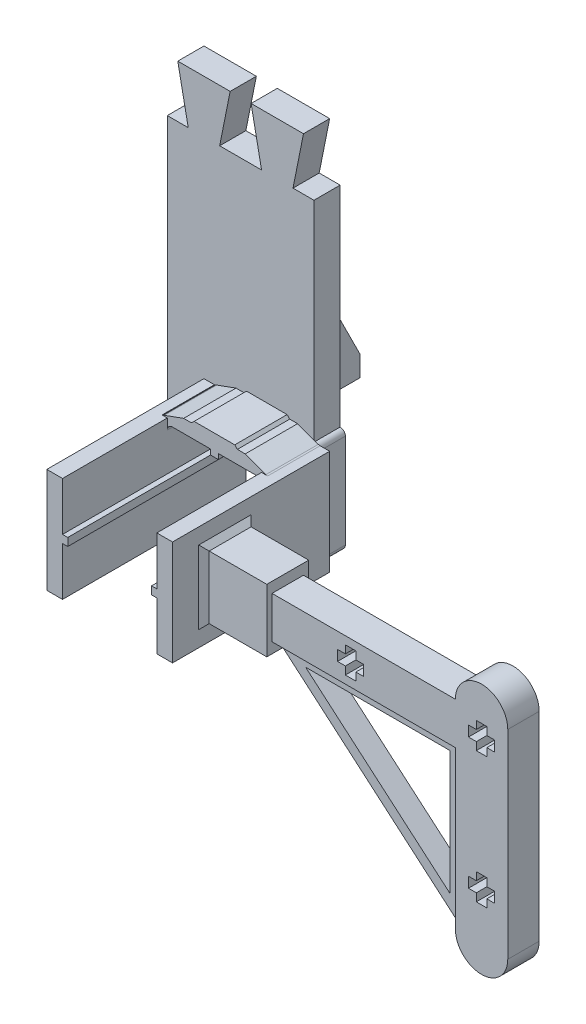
from build123d import *

# Parameters (mm, degrees)
SKETCH_1_W             = 20
SKETCH_1_H             = 20
SKETCH_1_W_2           = 18
SKETCH_1_H_2           = 18
EXTRUDE_1_DEPTH        = 10
FILLET_1_R             = 1
SKETCH_3_W             = 2
SKETCH_3_H             = 20
EXTRUDE_2_DEPTH        = 10
EXTRUDE_3_DEPTH        = 20
FILLET_3_R             = 1
SKETCH_5_W             = 1.5
SKETCH_5_H             = 2
SKETCH_5_W_2           = 2
SKETCH_5_H_2           = 1.5
EXTRUDE_4_DEPTH        = 10
SKETCH_6_W             = 12
SKETCH_6_H             = 12
EXTRUDE_5_DEPTH        = 4
SKETCH_7_W             = 6
SKETCH_7_H             = 8
EXTRUDE_6_DEPTH        = 35
EXTRUDE_7_DEPTH        = 3
RIB_1_REACH            = 83.744
SKETCH_11_WALL_W       = 211.584724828
SKETCH_11_WALL_H       = 4
CUT_EXTRUDE_1_DEPTH    = 83.255698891
CHAMFER_1_SIZE         = 1
CUT_EXTRUDE_2_DEPTH    = 6
PATTERN_LINEAR_1_COUNT = 2
PATTERN_LINEAR_1_PITCH = 25
PATTERN_LINEAR_2_COUNT = 2
PATTERN_LINEAR_2_PITCH = 25
SKETCH_14_W            = 1
SKETCH_14_H            = 1.5
SKETCH_14_W_2          = 1.5
SKETCH_14_H_2          = 1
EXTRUDE_10_DEPTH       = 5
SKETCH_17_W            = 18
SKETCH_17_H            = 5
EXTRUDE_11_DEPTH       = 50
EXTRUDE_START          = -5
EXTRUDE_12_DEPTH       = 5
CUT_EXTRUDE_3_DEPTH    = 38
SKETCH_22_W            = 1
SKETCH_22_H            = 1.5
EXTRUDE_13_DEPTH       = 20
EXTRUDE_16_DEPTH       = 1.5
SKETCH_24_W            = 1
SKETCH_24_H            = 1.5
EXTRUDE_17_DEPTH       = 20


with BuildPart() as part:
    # Sketch 1 → Extrude 1 (new body)
    # profile 1 of 4: a face of its own
    with BuildSketch(Plane.XY):
        Polygon((10, -10), (5.878783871, -11.5), (4.378783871, -11.5), (3.878783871, -12), (-3.878783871, -12), (-4.378783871, -11.5), (-5.878783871, -11.5), (-10, -10), align=None)
    # profile 2 of 4: a face of its own
    with BuildSketch(Plane.XY):
        Rectangle(SKETCH_1_W, SKETCH_1_H)
        Rectangle(SKETCH_1_W_2, SKETCH_1_H_2, mode=Mode.SUBTRACT)
    # profile 3 of 4: a face of its own
    with BuildSketch(Plane.XY):
        Polygon((-10, -10), (-11.5, -5.878783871), (-11.5, -4.378783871), (-12, -3.878783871), (-12, 3.878783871), (-11.5, 4.378783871), (-11.5, 5.878783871), (-10, 10), align=None)
    # profile 4 of 4: a face of its own
    with BuildSketch(Plane.XY):
        Polygon((-10, 10), (-5.878783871, 11.5), (-4.378783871, 11.5), (-3.878783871, 12), (3.878783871, 12), (4.378783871, 11.5), (5.878783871, 11.5), (10, 10), align=None)
    extrude(amount=EXTRUDE_1_DEPTH)

    # Fillet 1
    fillet_1_edges = [part.edges().sort_by_distance(p)[0] for p in [
        (-9, -9, 5),
        (9, -9, 5),
        (9, 9, 5),
        (-9, 9, 5),
    ]]
    fillet(fillet_1_edges, radius=FILLET_1_R)

    # Sketch 3 → Extrude 2 (add)
    with BuildSketch(Plane.XY.offset(10)):
        with Locations((11, 0)):
            Rectangle(SKETCH_3_W, SKETCH_3_H)
    extrude_2 = extrude(amount=-EXTRUDE_2_DEPTH)

    # Sketch 4 → Extrude 3 (add)
    with BuildSketch(Plane.XY.offset(10)):
        Polygon((10, 10), (9, 10), (9, -10), (12, -10), (12, 10), align=None)
    extrude_3 = extrude(amount=EXTRUDE_3_DEPTH)

    # Fillet 3
    fillet_3_edges = [part.edges().sort_by_distance(p)[0] for p in [
        (-10, -10, 5),
        (-10, 10, 5),
        (10, 10, 5),
        (10, -10, 5),
    ]]
    fillet(fillet_3_edges, radius=FILLET_3_R)

    # Sketch 5 → Extrude 4 (add)
    with BuildSketch(Plane.XY.offset(10)):
        with Locations((0, 9)):
            Rectangle(SKETCH_5_W, SKETCH_5_H)
        with Locations((9, 0)):
            Rectangle(SKETCH_5_W_2, SKETCH_5_H_2)
        with Locations((0, -9)):
            Rectangle(SKETCH_5_W, SKETCH_5_H)
        with Locations((-9, 0)):
            Rectangle(SKETCH_5_W_2, SKETCH_5_H_2)
    extrude(amount=-EXTRUDE_4_DEPTH)

    # Sketch 6 → Extrude 5 (add, symmetric)
    with BuildSketch(Plane.XY.offset(20)):
        with Locations((18, 0)):
            Rectangle(SKETCH_6_W, SKETCH_6_H)
    extrude(amount=EXTRUDE_5_DEPTH, both=True)

    # Sketch 7 → Extrude 6 (add)
    with BuildSketch(Plane(origin=(24, 0, 0), x_dir=(0, 0, -1), z_dir=(1, 0, 0))):
        with Locations((-20, 0)):
            Rectangle(SKETCH_7_W, SKETCH_7_H)
    extrude(amount=EXTRUDE_6_DEPTH)

    # Sketch 8 → Extrude 7 (add, symmetric)
    with BuildSketch(Plane.XY.offset(20)):
        with BuildLine():
            Line((69, 4), (69, -34))
            ThreePointArc((69, -34), (64, -39), (59, -34))
            Line((59, -34), (59, 4))
            ThreePointArc((59, 4), (64, 9), (69, 4))
        make_face()
    extrude(amount=EXTRUDE_7_DEPTH, both=True)

    # Sketch 11 wall → Rib 1 (add, up to next)
    with BuildSketch(Plane(origin=(41.5, -19, 20), x_dir=(0.759256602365, -0.650791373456, 0), z_dir=(0.650791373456, 0.759256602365, 0)), mode=Mode.PRIVATE) as rib_1_sk1:
        Rectangle(SKETCH_11_WALL_W, SKETCH_11_WALL_H)
    rib_1_tool1 = extrude(rib_1_sk1.sketch, amount=RIB_1_REACH, mode=Mode.PRIVATE) - part.part
    add(rib_1_tool1.solids().sort_by_distance((41.5, -19, 20))[0])

    # Sketch 12 → Cut-Extrude 1 (cut, through all)
    with BuildSketch(Plane.XY.offset(22)):
        Polygon((29.406514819, -6), (57, -29.651558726), (57, -6), align=None)
    extrude(amount=-CUT_EXTRUDE_1_DEPTH, mode=Mode.SUBTRACT)

    # Chamfer 1
    chamfer_1_edges = [part.edges().sort_by_distance(p)[0] for p in [
        (12, 0, 16),
        (12, 6, 20),
        (12, -6, 20),
        (12, 0, 24),
    ]]
    chamfer(chamfer_1_edges, length=CHAMFER_1_SIZE)

    # Sketch 13 → Cut-Extrude 2 (cut)
    with BuildSketch(Plane.XY.offset(23)):
        Polygon((65, 1), (65, 2.5), (63, 2.5), (63, 1), (61.5, 1), (61.5, -1), (63, -1), (63, -2.5), (65, -2.5), (65, -1), (66.5, -1), (66.5, 1), align=None)
    cut_extrude_2 = extrude(amount=-CUT_EXTRUDE_2_DEPTH, mode=Mode.SUBTRACT)

    # Pattern Linear 1: Cut-Extrude 2 ×2
    with Locations(*[(0, -i * PATTERN_LINEAR_1_PITCH, 0) for i in range(1, PATTERN_LINEAR_1_COUNT)]):
        add(cut_extrude_2, mode=Mode.SUBTRACT)

    # Pattern Linear 2: Cut-Extrude 2 ×2
    with Locations(*[(-i * PATTERN_LINEAR_2_PITCH, 0, 0) for i in range(1, PATTERN_LINEAR_2_COUNT)]):
        add(cut_extrude_2, mode=Mode.SUBTRACT)

    # Sketch 14 → Extrude 10 (add)
    with BuildSketch(Plane(origin=(0, 0, 0), x_dir=(-1, 0, 0), z_dir=(0, 0, -1))):
        with BuildLine():
            Line((0.75, 9), (8, 9))
            ThreePointArc((8, 9), (8.707106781, 8.707106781), (9, 8))
            Line((9, 8), (9, 0.75))
            Line((9, 0.75), (10, 0.75))
            Line((10, 0.75), (10, 9))
            ThreePointArc((10, 9), (9.707106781, 9.707106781), (9, 10))
            Line((9, 10), (0.75, 10))
            Line((0.75, 10), (0.75, 9))
        make_face()
        with Locations((9.5, 0)):
            Rectangle(SKETCH_14_W, SKETCH_14_H)
        with Locations((8.5, 0)):
            Rectangle(SKETCH_14_W, SKETCH_14_H)
        with BuildLine():
            Line((10, -0.75), (9, -0.75))
            Line((9, -0.75), (9, -8))
            ThreePointArc((9, -8), (8.707106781, -8.707106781), (8, -9))
            Line((8, -9), (0.75, -9))
            Line((0.75, -9), (0.75, -10))
            Line((0.75, -10), (9, -10))
            ThreePointArc((9, -10), (9.707106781, -9.707106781), (10, -9))
            Line((10, -9), (10, -0.75))
        make_face()
        with Locations((0, -9.5)):
            Rectangle(SKETCH_14_W_2, SKETCH_14_H_2)
        with Locations((0, -8.5)):
            Rectangle(SKETCH_14_W_2, SKETCH_14_H_2)
        with BuildLine():
            Line((-9, -8), (-9, -0.75))
            Line((-9, -0.75), (-10, -0.75))
            Line((-10, -0.75), (-10, -9))
            ThreePointArc((-10, -9), (-9.707106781, -9.707106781), (-9, -10))
            Line((-9, -10), (-0.75, -10))
            Line((-0.75, -10), (-0.75, -9))
            Line((-0.75, -9), (-8, -9))
            ThreePointArc((-8, -9), (-8.707106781, -8.707106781), (-9, -8))
        make_face()
        with Locations((-8.5, 0)):
            Rectangle(SKETCH_14_W, SKETCH_14_H)
        with Locations((-9.5, 0)):
            Rectangle(SKETCH_14_W, SKETCH_14_H)
        with BuildLine():
            Line((-8, 9), (-0.75, 9))
            Line((-0.75, 9), (-0.75, 10))
            Line((-0.75, 10), (-9, 10))
            ThreePointArc((-9, 10), (-9.707106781, 9.707106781), (-10, 9))
            Line((-10, 9), (-10, 0.75))
            Line((-10, 0.75), (-9, 0.75))
            Line((-9, 0.75), (-9, 8))
            ThreePointArc((-9, 8), (-8.707106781, 8.707106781), (-8, 9))
        make_face()
        with Locations((0, 9.5)):
            Rectangle(SKETCH_14_W_2, SKETCH_14_H_2)
        with Locations((0, 8.5)):
            Rectangle(SKETCH_14_W_2, SKETCH_14_H_2)
    extrude(amount=EXTRUDE_10_DEPTH)

    # Sketch 17 → Extrude 11 (add)
    with BuildSketch(Plane(origin=(0, 10, 0), x_dir=(1, 0, 0), z_dir=(0, 1, 0))):
        with Locations((0, 2.5)):
            Rectangle(SKETCH_17_W, SKETCH_17_H)
    extrude(amount=EXTRUDE_11_DEPTH)

    # Sketch 20 → Extrude 12 (add)
    with BuildSketch(Plane(origin=(0, 0, -5), x_dir=(-1, 0, 0), z_dir=(0, 0, -1)).offset(EXTRUDE_START)):
        with BuildLine():
            Line((9, 60), (9, 10))
            ThreePointArc((9, 10), (9.707106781, 9.707106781), (10, 9))
            Line((10, 9), (10, -9))
            Line((10, -9), (19, -9))
            Line((19, -9), (19, 60))
            Line((19, 60), (9, 60))
        make_face()
    extrude(amount=EXTRUDE_12_DEPTH)

    # Sketch 21 → Cut-Extrude 3 (cut)
    with BuildSketch(Plane(origin=(0, 0, -5), x_dir=(-1, 0, 0), z_dir=(0, 0, -1))):
        Polygon((-7, 60), (-9, 60), (-9, 50), (-5, 50), align=None)
        Polygon((5, 60), (3, 60), (1, 50), (5, 50), align=None)
        Polygon((7, 60), (5, 60), (5, 50), (9, 50), align=None)
        Polygon((19, 60), (17, 60), (15, 50), (19, 50), align=None)
    extrude(amount=-CUT_EXTRUDE_3_DEPTH, mode=Mode.SUBTRACT)

    # Sketch 22 → Extrude 13 (add)
    with BuildSketch(Plane.XY.offset(10)):
        with Locations((8.5, 0)):
            Rectangle(SKETCH_22_W, SKETCH_22_H)
    extrude(amount=EXTRUDE_13_DEPTH)

    # Sketch 23 → Extrude 16 (add)
    with BuildSketch(Plane.ZY.offset(0.75)):
        Polygon((-5, 8), (-17, 8), (-17, 12), (-11, 24), (-5, 24), align=None)
    extrude(amount=-EXTRUDE_16_DEPTH)

    # Mirror 1: Extrude 2, Extrude 3 across plane
    add(extrude_2.mirror(Plane(origin=(0, 0, 0), x_dir=(0, 0, 1), z_dir=(1, 0, 0))))
    add(extrude_3.mirror(Plane(origin=(0, 0, 0), x_dir=(0, 0, 1), z_dir=(1, 0, 0))))

    # Sketch 24 → Extrude 17 (add)
    with BuildSketch(Plane.XY.offset(10)):
        with Locations((-8.5, 0)):
            Rectangle(SKETCH_24_W, SKETCH_24_H)
    extrude(amount=EXTRUDE_17_DEPTH)


solid = part.part
